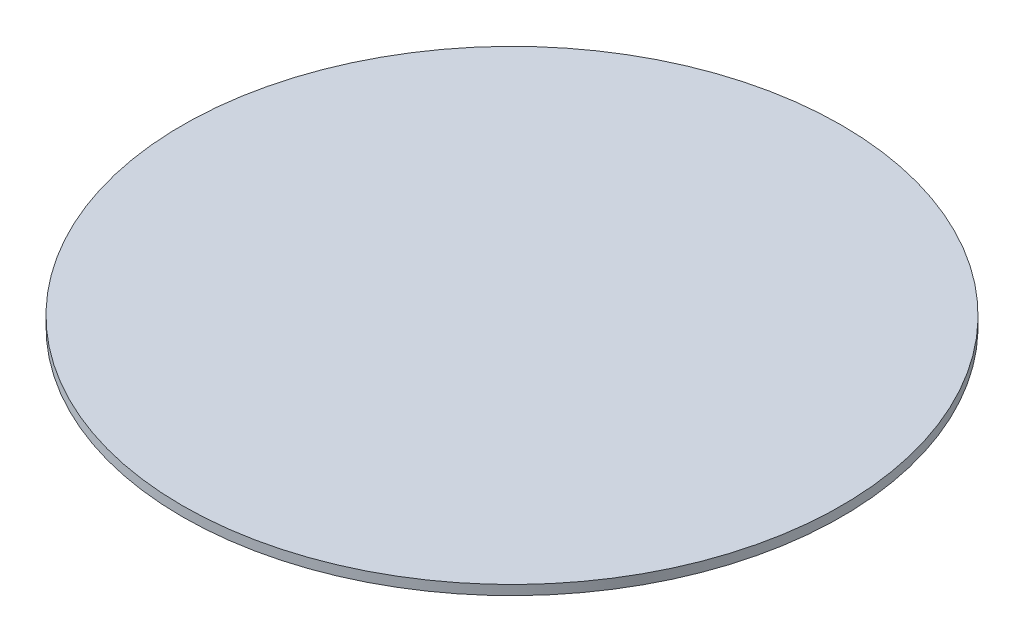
ISO-10303-21;
HEADER;
FILE_DESCRIPTION(('STEP AP214'),'2;1');
FILE_NAME('part.step','',(''),(''),'','','');
FILE_SCHEMA(('AUTOMOTIVE_DESIGN { 1 0 10303 214 1 1 1 1 }'));
ENDSEC;
DATA;
#1=APPLICATION_CONTEXT('core data for automotive mechanical design processes');
#2=APPLICATION_PROTOCOL_DEFINITION('international standard','automotive_design',2000,#1);
#3=PRODUCT_CONTEXT('',#1,'mechanical');
#4=PRODUCT('Part','Part','',(#3));
#5=PRODUCT_RELATED_PRODUCT_CATEGORY('part','',(#4));
#6=PRODUCT_DEFINITION_FORMATION('','',#4);
#7=PRODUCT_DEFINITION_CONTEXT('part definition',#1,'design');
#8=PRODUCT_DEFINITION('design','',#6,#7);
#9=PRODUCT_DEFINITION_SHAPE('','',#8);
#10=(LENGTH_UNIT() NAMED_UNIT(*) SI_UNIT(.MILLI.,.METRE.));
#11=(NAMED_UNIT(*) PLANE_ANGLE_UNIT() SI_UNIT($,.RADIAN.));
#12=(NAMED_UNIT(*) SI_UNIT($,.STERADIAN.) SOLID_ANGLE_UNIT());
#13=UNCERTAINTY_MEASURE_WITH_UNIT(LENGTH_MEASURE(1.E-05),#10,'distance_accuracy_value','');
#14=(GEOMETRIC_REPRESENTATION_CONTEXT(3) GLOBAL_UNCERTAINTY_ASSIGNED_CONTEXT((#13)) GLOBAL_UNIT_ASSIGNED_CONTEXT((#10,
#11,#12)) REPRESENTATION_CONTEXT('',''));
#15=CARTESIAN_POINT('',(0.,0.,0.));
#16=DIRECTION('',(0.,0.,1.));
#17=DIRECTION('',(1.,0.,0.));
#18=AXIS2_PLACEMENT_3D('',#15,#16,#17);
#19=CARTESIAN_POINT('',(0.,1.1,0.));
#20=DIRECTION('',(0.,-1.,0.));
#21=DIRECTION('',(0.,0.,-1.));
#22=AXIS2_PLACEMENT_3D('',#19,#20,#21);
#23=CYLINDRICAL_SURFACE('',#22,37.5);
#24=CARTESIAN_POINT('',(0.,1.1,0.));
#25=DIRECTION('',(0.,1.,0.));
#26=DIRECTION('',(0.,0.,1.));
#27=AXIS2_PLACEMENT_3D('',#24,#25,#26);
#28=CIRCLE('',#27,37.5);
#29=CARTESIAN_POINT('',(0.,1.1,37.5));
#30=VERTEX_POINT('',#29);
#31=EDGE_CURVE('E10',#30,#30,#28,.T.);
#32=ORIENTED_EDGE('',*,*,#31,.F.);
#33=EDGE_LOOP('',(#32));
#34=FACE_BOUND('',#33,.T.);
#35=CARTESIAN_POINT('',(0.,0.,0.));
#36=DIRECTION('',(0.,1.,0.));
#37=DIRECTION('',(0.,0.,1.));
#38=AXIS2_PLACEMENT_3D('',#35,#36,#37);
#39=CIRCLE('',#38,37.5);
#40=CARTESIAN_POINT('',(0.,0.,37.5));
#41=VERTEX_POINT('',#40);
#42=EDGE_CURVE('E40',#41,#41,#39,.T.);
#43=ORIENTED_EDGE('',*,*,#42,.T.);
#44=EDGE_LOOP('',(#43));
#45=FACE_BOUND('',#44,.T.);
#46=ADVANCED_FACE('F37',(#34,#45),#23,.T.);
#47=CARTESIAN_POINT('',(0.,1.1,0.));
#48=DIRECTION('',(0.,1.,0.));
#49=DIRECTION('',(0.,0.,1.));
#50=AXIS2_PLACEMENT_3D('',#47,#48,#49);
#51=PLANE('',#50);
#52=ORIENTED_EDGE('',*,*,#31,.T.);
#53=EDGE_LOOP('',(#52));
#54=FACE_BOUND('',#53,.T.);
#55=ADVANCED_FACE('F54',(#54),#51,.T.);
#56=CARTESIAN_POINT('',(0.,0.,0.));
#57=DIRECTION('',(0.,1.,0.));
#58=DIRECTION('',(0.,0.,1.));
#59=AXIS2_PLACEMENT_3D('',#56,#57,#58);
#60=PLANE('',#59);
#61=ORIENTED_EDGE('',*,*,#42,.F.);
#62=EDGE_LOOP('',(#61));
#63=FACE_BOUND('',#62,.T.);
#64=ADVANCED_FACE('F52',(#63),#60,.F.);
#65=CLOSED_SHELL('',(#46,#55,#64));
#66=MANIFOLD_SOLID_BREP('B2',#65);
#67=ADVANCED_BREP_SHAPE_REPRESENTATION('',(#18,#66),#14);
#68=SHAPE_DEFINITION_REPRESENTATION(#9,#67);
ENDSEC;
END-ISO-10303-21;
